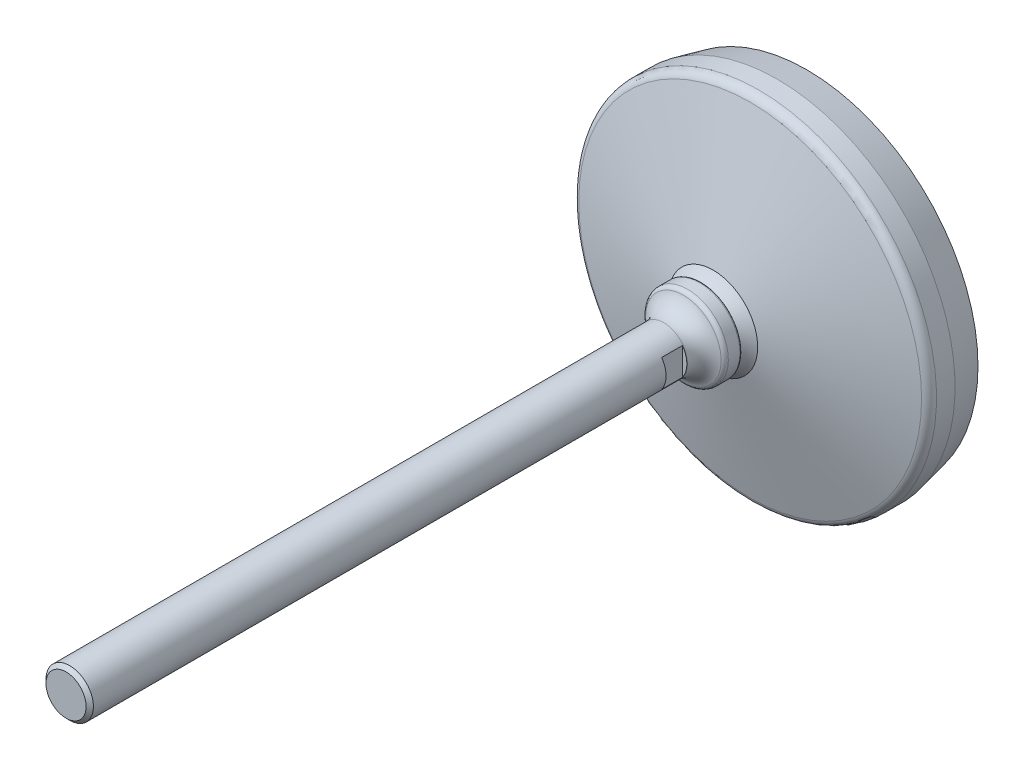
ISO-10303-21;
HEADER;
FILE_DESCRIPTION(('STEP AP214'),'2;1');
FILE_NAME('part.step','',(''),(''),'','','');
FILE_SCHEMA(('AUTOMOTIVE_DESIGN { 1 0 10303 214 1 1 1 1 }'));
ENDSEC;
DATA;
#1=APPLICATION_CONTEXT('core data for automotive mechanical design processes');
#2=APPLICATION_PROTOCOL_DEFINITION('international standard','automotive_design',2000,#1);
#3=PRODUCT_CONTEXT('',#1,'mechanical');
#4=PRODUCT('Part','Part','',(#3));
#5=PRODUCT_RELATED_PRODUCT_CATEGORY('part','',(#4));
#6=PRODUCT_DEFINITION_FORMATION('','',#4);
#7=PRODUCT_DEFINITION_CONTEXT('part definition',#1,'design');
#8=PRODUCT_DEFINITION('design','',#6,#7);
#9=PRODUCT_DEFINITION_SHAPE('','',#8);
#10=(LENGTH_UNIT() NAMED_UNIT(*) SI_UNIT(.MILLI.,.METRE.));
#11=(NAMED_UNIT(*) PLANE_ANGLE_UNIT() SI_UNIT($,.RADIAN.));
#12=(NAMED_UNIT(*) SI_UNIT($,.STERADIAN.) SOLID_ANGLE_UNIT());
#13=UNCERTAINTY_MEASURE_WITH_UNIT(LENGTH_MEASURE(1.E-05),#10,'distance_accuracy_value','');
#14=(GEOMETRIC_REPRESENTATION_CONTEXT(3) GLOBAL_UNCERTAINTY_ASSIGNED_CONTEXT((#13)) GLOBAL_UNIT_ASSIGNED_CONTEXT((#10,
#11,#12)) REPRESENTATION_CONTEXT('',''));
#15=CARTESIAN_POINT('',(0.,0.,0.));
#16=DIRECTION('',(0.,0.,1.));
#17=DIRECTION('',(1.,0.,0.));
#18=AXIS2_PLACEMENT_3D('',#15,#16,#17);
#19=CARTESIAN_POINT('',(0.,0.,40.9905717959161));
#20=DIRECTION('',(0.,0.,-1.));
#21=DIRECTION('',(0.,1.,0.));
#22=AXIS2_PLACEMENT_3D('',#19,#20,#21);
#23=TOROIDAL_SURFACE('',#22,22.4710883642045,12.0000000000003);
#24=CARTESIAN_POINT('',(0.,0.,31.6));
#25=DIRECTION('',(0.,0.,-1.));
#26=DIRECTION('',(0.,1.,0.));
#27=AXIS2_PLACEMENT_3D('',#24,#25,#26);
#28=CIRCLE('',#27,15.);
#29=CARTESIAN_POINT('',(0.,15.,31.6));
#30=VERTEX_POINT('',#29);
#31=EDGE_CURVE('E86',#30,#30,#28,.T.);
#32=ORIENTED_EDGE('',*,*,#31,.F.);
#33=EDGE_LOOP('',(#32));
#34=FACE_BOUND('',#33,.T.);
#35=CARTESIAN_POINT('',(0.,0.,35.6));
#36=DIRECTION('',(0.,0.,-1.));
#37=DIRECTION('',(0.,1.,0.));
#38=AXIS2_PLACEMENT_3D('',#35,#36,#37);
#39=CIRCLE('',#38,11.75);
#40=CARTESIAN_POINT('',(0.,11.75,35.6));
#41=VERTEX_POINT('',#40);
#42=EDGE_CURVE('E61',#41,#41,#39,.T.);
#43=ORIENTED_EDGE('',*,*,#42,.T.);
#44=EDGE_LOOP('',(#43));
#45=FACE_BOUND('',#44,.T.);
#46=ADVANCED_FACE('F14',(#34,#45),#23,.F.);
#47=CARTESIAN_POINT('',(0.,0.,31.6));
#48=DIRECTION('',(0.,0.,-1.));
#49=DIRECTION('',(0.,1.,0.));
#50=AXIS2_PLACEMENT_3D('',#47,#48,#49);
#51=CONICAL_SURFACE('',#50,15.,1.2875142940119);
#52=CARTESIAN_POINT('',(0.,0.,19.1292293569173));
#53=DIRECTION('',(0.,0.,-1.));
#54=DIRECTION('',(0.,1.,0.));
#55=AXIS2_PLACEMENT_3D('',#52,#53,#54);
#56=CIRCLE('',#55,57.8385251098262);
#57=CARTESIAN_POINT('',(0.,57.8385251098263,19.1292293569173));
#58=VERTEX_POINT('',#57);
#59=EDGE_CURVE('E89',#58,#58,#56,.T.);
#60=CARTESIAN_POINT('',(0.,57.8385251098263,19.1292293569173));
#61=CARTESIAN_POINT('',(0.,57.3922904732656,19.2591332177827));
#62=CARTESIAN_POINT('',(0.,56.9460558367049,19.3890370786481));
#63=CARTESIAN_POINT('',(0.,56.0535865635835,19.648844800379));
#64=CARTESIAN_POINT('',(0.,55.6073519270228,19.7787486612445));
#65=CARTESIAN_POINT('',(0.,54.7148826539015,20.0385563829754));
#66=CARTESIAN_POINT('',(0.,54.2686480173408,20.1684602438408));
#67=CARTESIAN_POINT('',(0.,53.3761787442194,20.4282679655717));
#68=CARTESIAN_POINT('',(0.,52.9299441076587,20.5581718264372));
#69=CARTESIAN_POINT('',(0.,52.0374748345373,20.817979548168));
#70=CARTESIAN_POINT('',(0.,51.5912401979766,20.9478834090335));
#71=CARTESIAN_POINT('',(0.,50.6987709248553,21.2076911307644));
#72=CARTESIAN_POINT('',(0.,50.2525362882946,21.3375949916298));
#73=CARTESIAN_POINT('',(0.,49.3600670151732,21.5974027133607));
#74=CARTESIAN_POINT('',(0.,48.9138323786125,21.7273065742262));
#75=CARTESIAN_POINT('',(0.,48.0213631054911,21.9871142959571));
#76=CARTESIAN_POINT('',(0.,47.5751284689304,22.1170181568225));
#77=CARTESIAN_POINT('',(0.,46.682659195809,22.3768258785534));
#78=CARTESIAN_POINT('',(0.,46.2364245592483,22.5067297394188));
#79=CARTESIAN_POINT('',(0.,45.343955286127,22.7665374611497));
#80=CARTESIAN_POINT('',(0.,44.8977206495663,22.8964413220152));
#81=CARTESIAN_POINT('',(0.,44.0052513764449,23.1562490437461));
#82=CARTESIAN_POINT('',(0.,43.5590167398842,23.2861529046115));
#83=CARTESIAN_POINT('',(0.,42.6665474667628,23.5459606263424));
#84=CARTESIAN_POINT('',(0.,42.2203128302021,23.6758644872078));
#85=CARTESIAN_POINT('',(0.,41.3278435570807,23.9356722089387));
#86=CARTESIAN_POINT('',(0.,40.8816089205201,24.0655760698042));
#87=CARTESIAN_POINT('',(0.,39.9891396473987,24.3253837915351));
#88=CARTESIAN_POINT('',(0.,39.542905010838,24.4552876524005));
#89=CARTESIAN_POINT('',(0.,38.6504357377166,24.7150953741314));
#90=CARTESIAN_POINT('',(0.,38.2042011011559,24.8449992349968));
#91=CARTESIAN_POINT('',(0.,37.3117318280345,25.1048069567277));
#92=CARTESIAN_POINT('',(0.,36.8654971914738,25.2347108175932));
#93=CARTESIAN_POINT('',(0.,35.9730279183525,25.4945185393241));
#94=CARTESIAN_POINT('',(0.,35.5267932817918,25.6244224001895));
#95=CARTESIAN_POINT('',(0.,34.6343240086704,25.8842301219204));
#96=CARTESIAN_POINT('',(0.,34.1880893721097,26.0141339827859));
#97=CARTESIAN_POINT('',(0.,33.2956200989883,26.2739417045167));
#98=CARTESIAN_POINT('',(0.,32.8493854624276,26.4038455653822));
#99=CARTESIAN_POINT('',(0.,31.9569161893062,26.6636532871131));
#100=CARTESIAN_POINT('',(0.,31.5106815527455,26.7935571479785));
#101=CARTESIAN_POINT('',(0.,30.6182122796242,27.0533648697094));
#102=CARTESIAN_POINT('',(0.,30.1719776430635,27.1832687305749));
#103=CARTESIAN_POINT('',(0.,29.2795083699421,27.4430764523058));
#104=CARTESIAN_POINT('',(0.,28.8332737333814,27.5729803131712));
#105=CARTESIAN_POINT('',(0.,27.94080446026,27.8327880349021));
#106=CARTESIAN_POINT('',(0.,27.4945698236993,27.9626918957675));
#107=CARTESIAN_POINT('',(0.,26.602100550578,28.2224996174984));
#108=CARTESIAN_POINT('',(0.,26.1558659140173,28.3524034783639));
#109=CARTESIAN_POINT('',(0.,25.2633966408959,28.6122112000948));
#110=CARTESIAN_POINT('',(0.,24.8171620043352,28.7421150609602));
#111=CARTESIAN_POINT('',(0.,23.9246927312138,29.0019227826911));
#112=CARTESIAN_POINT('',(0.,23.4784580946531,29.1318266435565));
#113=CARTESIAN_POINT('',(0.,22.5859888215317,29.3916343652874));
#114=CARTESIAN_POINT('',(0.,22.139754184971,29.5215382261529));
#115=CARTESIAN_POINT('',(0.,21.2472849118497,29.7813459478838));
#116=CARTESIAN_POINT('',(0.,20.801050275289,29.9112498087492));
#117=CARTESIAN_POINT('',(0.,19.9085810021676,30.1710575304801));
#118=CARTESIAN_POINT('',(0.,19.4623463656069,30.3009613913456));
#119=CARTESIAN_POINT('',(0.,18.5698770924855,30.5607691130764));
#120=CARTESIAN_POINT('',(0.,18.1236424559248,30.6906729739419));
#121=CARTESIAN_POINT('',(0.,17.2311731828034,30.9504806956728));
#122=CARTESIAN_POINT('',(0.,16.7849385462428,31.0803845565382));
#123=CARTESIAN_POINT('',(0.,15.8924692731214,31.3401922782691));
#124=CARTESIAN_POINT('',(0.,15.4462346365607,31.4700961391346));
#125=CARTESIAN_POINT('',(0.,15.,31.6));
#126=B_SPLINE_CURVE_WITH_KNOTS('',3,(#60,#61,#62,#63,#64,#65,#66,#67,#68,#69,#70,#71,#72,#73,
#74,#75,#76,#77,#78,#79,#80,#81,#82,#83,#84,#85,#86,#87,#88,#89,#90,#91,#92,#93,#94,#95,#96,#97,
#98,#99,#100,#101,#102,#103,#104,#105,#106,#107,#108,#109,#110,#111,#112,#113,#114,#115,#116,
#117,#118,#119,#120,#121,#122,#123,#124,#125),.UNSPECIFIED.,.F.,.F.,(4,2,2,2,2,2,2,2,2,2,2,2,2,
2,2,2,2,2,2,2,2,2,2,2,2,2,2,2,2,2,2,2,4),(0.,1.39427517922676,2.78855035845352,4.18282553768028,
5.57710071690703,6.97137589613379,8.36565107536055,9.75992625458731,11.1542014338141,
12.5484766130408,13.9427517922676,15.3370269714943,16.7313021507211,18.1255773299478,
19.5198525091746,20.9141276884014,22.3084028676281,23.7026780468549,25.0969532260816,
26.4912284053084,27.8855035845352,29.2797787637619,30.6740539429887,32.0683291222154,
33.4626043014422,34.856879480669,36.2511546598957,37.6454298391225,39.0397050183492,
40.433980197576,41.8282553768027,43.2225305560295,44.6168057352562),.UNSPECIFIED.);
#127=EDGE_CURVE('BSEAM147',#58,#30,#126,.T.);
#128=ORIENTED_EDGE('',*,*,#59,.F.);
#129=ORIENTED_EDGE('',*,*,#31,.T.);
#130=ORIENTED_EDGE('',*,*,#127,.T.);
#131=ORIENTED_EDGE('',*,*,#127,.F.);
#132=EDGE_LOOP('',(#128,#130,#129,#131));
#133=FACE_BOUND('',#132,.T.);
#134=ADVANCED_FACE('F147',(#133),#51,.T.);
#135=CARTESIAN_POINT('',(0.,0.,16.2487995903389));
#136=DIRECTION('',(0.,0.,-1.));
#137=DIRECTION('',(0.,1.,0.));
#138=AXIS2_PLACEMENT_3D('',#135,#136,#137);
#139=TOROIDAL_SURFACE('',#138,57.,2.99999999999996);
#140=ORIENTED_EDGE('',*,*,#59,.T.);
#141=EDGE_LOOP('',(#140));
#142=FACE_BOUND('',#141,.T.);
#143=CARTESIAN_POINT('',(0.,0.,16.2487995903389));
#144=DIRECTION('',(0.,0.,-1.));
#145=DIRECTION('',(0.,1.,0.));
#146=AXIS2_PLACEMENT_3D('',#143,#144,#145);
#147=CIRCLE('',#146,60.);
#148=CARTESIAN_POINT('',(0.,60.,16.2487995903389));
#149=VERTEX_POINT('',#148);
#150=EDGE_CURVE('E92',#149,#149,#147,.T.);
#151=ORIENTED_EDGE('',*,*,#150,.F.);
#152=EDGE_LOOP('',(#151));
#153=FACE_BOUND('',#152,.T.);
#154=ADVANCED_FACE('F153',(#142,#153),#139,.T.);
#155=CARTESIAN_POINT('',(0.,0.,0.));
#156=DIRECTION('',(0.,0.,-1.));
#157=DIRECTION('',(0.,1.,0.));
#158=AXIS2_PLACEMENT_3D('',#155,#156,#157);
#159=CYLINDRICAL_SURFACE('',#158,60.);
#160=CARTESIAN_POINT('',(0.,0.,10.));
#161=DIRECTION('',(0.,0.,-1.));
#162=DIRECTION('',(0.,1.,0.));
#163=AXIS2_PLACEMENT_3D('',#160,#161,#162);
#164=CIRCLE('',#163,60.);
#165=CARTESIAN_POINT('',(0.,60.,10.));
#166=VERTEX_POINT('',#165);
#167=EDGE_CURVE('E95',#166,#166,#164,.T.);
#168=ORIENTED_EDGE('',*,*,#167,.F.);
#169=EDGE_LOOP('',(#168));
#170=FACE_BOUND('',#169,.T.);
#171=ORIENTED_EDGE('',*,*,#150,.T.);
#172=EDGE_LOOP('',(#171));
#173=FACE_BOUND('',#172,.T.);
#174=ADVANCED_FACE('F198',(#170,#173),#159,.T.);
#175=CARTESIAN_POINT('',(0.,0.,10.));
#176=DIRECTION('',(0.,0.,1.));
#177=DIRECTION('',(0.,-1.,0.));
#178=AXIS2_PLACEMENT_3D('',#175,#176,#177);
#179=CONICAL_SURFACE('',#178,60.,0.221314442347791);
#180=CARTESIAN_POINT('',(0.,0.,0.));
#181=DIRECTION('',(0.,0.,-1.));
#182=DIRECTION('',(0.,1.,0.));
#183=AXIS2_PLACEMENT_3D('',#180,#181,#182);
#184=CIRCLE('',#183,57.75);
#185=CARTESIAN_POINT('',(0.,57.75,0.));
#186=VERTEX_POINT('',#185);
#187=EDGE_CURVE('E98',#186,#186,#184,.T.);
#188=ORIENTED_EDGE('',*,*,#187,.F.);
#189=EDGE_LOOP('',(#188));
#190=FACE_BOUND('',#189,.T.);
#191=ORIENTED_EDGE('',*,*,#167,.T.);
#192=EDGE_LOOP('',(#191));
#193=FACE_BOUND('',#192,.T.);
#194=ADVANCED_FACE('F194',(#190,#193),#179,.T.);
#195=CARTESIAN_POINT('',(57.75,0.,0.));
#196=DIRECTION('',(0.,0.,1.));
#197=DIRECTION('',(0.,-1.,0.));
#198=AXIS2_PLACEMENT_3D('',#195,#196,#197);
#199=PLANE('',#198);
#200=ORIENTED_EDGE('',*,*,#187,.T.);
#201=EDGE_LOOP('',(#200));
#202=FACE_BOUND('',#201,.T.);
#203=ADVANCED_FACE('F187',(#202),#199,.F.);
#204=CARTESIAN_POINT('',(0.,0.,16.));
#205=DIRECTION('',(0.,0.,-1.));
#206=DIRECTION('',(0.,1.,0.));
#207=AXIS2_PLACEMENT_3D('',#204,#205,#206);
#208=CYLINDRICAL_SURFACE('',#207,8.);
#209=CARTESIAN_POINT('',(0.,0.,48.3));
#210=DIRECTION('',(0.,0.,-1.));
#211=DIRECTION('',(0.,1.,0.));
#212=AXIS2_PLACEMENT_3D('',#209,#210,#211);
#213=CIRCLE('',#212,8.);
#214=CARTESIAN_POINT('',(0.,8.,48.3));
#215=VERTEX_POINT('',#214);
#216=EDGE_CURVE('E107',#215,#215,#213,.T.);
#217=ORIENTED_EDGE('',*,*,#216,.F.);
#218=EDGE_LOOP('',(#217));
#219=FACE_BOUND('',#218,.T.);
#220=DIRECTION('',(0.,0.,-1.));
#221=VECTOR('',#220,1.);
#222=CARTESIAN_POINT('',(6.5,-4.66368952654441,16.));
#223=LINE('',#222,#221);
#224=CARTESIAN_POINT('',(6.5,-4.66368952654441,48.5));
#225=VERTEX_POINT('',#224);
#226=CARTESIAN_POINT('',(6.5,-4.66368952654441,55.5));
#227=VERTEX_POINT('',#226);
#228=EDGE_CURVE('E77',#225,#227,#223,.F.);
#229=ORIENTED_EDGE('',*,*,#228,.T.);
#230=CARTESIAN_POINT('',(0.,0.,55.5));
#231=DIRECTION('',(0.,0.,1.));
#232=DIRECTION('',(0.,-1.,0.));
#233=AXIS2_PLACEMENT_3D('',#230,#231,#232);
#234=CIRCLE('',#233,8.);
#235=CARTESIAN_POINT('',(6.5,4.66368952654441,55.5));
#236=VERTEX_POINT('',#235);
#237=EDGE_CURVE('E9',#227,#236,#234,.T.);
#238=ORIENTED_EDGE('',*,*,#237,.T.);
#239=DIRECTION('',(0.,0.,-1.));
#240=VECTOR('',#239,1.);
#241=CARTESIAN_POINT('',(6.5,4.66368952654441,16.));
#242=LINE('',#241,#240);
#243=CARTESIAN_POINT('',(6.5,4.66368952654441,48.5));
#244=VERTEX_POINT('',#243);
#245=EDGE_CURVE('E17',#236,#244,#242,.T.);
#246=ORIENTED_EDGE('',*,*,#245,.T.);
#247=CARTESIAN_POINT('',(0.,0.,48.5));
#248=DIRECTION('',(0.,0.,1.));
#249=DIRECTION('',(0.,-1.,0.));
#250=AXIS2_PLACEMENT_3D('',#247,#248,#249);
#251=CIRCLE('',#250,8.);
#252=EDGE_CURVE('E63',#225,#244,#251,.T.);
#253=ORIENTED_EDGE('',*,*,#252,.F.);
#254=EDGE_LOOP('',(#229,#238,#246,#253));
#255=FACE_BOUND('',#254,.T.);
#256=DIRECTION('',(0.,0.,-1.));
#257=VECTOR('',#256,1.);
#258=CARTESIAN_POINT('',(-6.5,4.66368952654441,16.));
#259=LINE('',#258,#257);
#260=CARTESIAN_POINT('',(-6.5,4.66368952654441,48.5));
#261=VERTEX_POINT('',#260);
#262=CARTESIAN_POINT('',(-6.5,4.66368952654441,55.5));
#263=VERTEX_POINT('',#262);
#264=EDGE_CURVE('E60',#261,#263,#259,.F.);
#265=ORIENTED_EDGE('',*,*,#264,.T.);
#266=CARTESIAN_POINT('',(-6.5,-4.66368952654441,55.5));
#267=VERTEX_POINT('',#266);
#268=EDGE_CURVE('E23',#263,#267,#234,.T.);
#269=ORIENTED_EDGE('',*,*,#268,.T.);
#270=DIRECTION('',(0.,0.,-1.));
#271=VECTOR('',#270,1.);
#272=CARTESIAN_POINT('',(-6.5,-4.66368952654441,16.));
#273=LINE('',#272,#271);
#274=CARTESIAN_POINT('',(-6.5,-4.66368952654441,48.5));
#275=VERTEX_POINT('',#274);
#276=EDGE_CURVE('E67',#267,#275,#273,.T.);
#277=ORIENTED_EDGE('',*,*,#276,.T.);
#278=EDGE_CURVE('E55',#261,#275,#251,.T.);
#279=ORIENTED_EDGE('',*,*,#278,.F.);
#280=EDGE_LOOP('',(#265,#269,#277,#279));
#281=FACE_BOUND('',#280,.T.);
#282=CARTESIAN_POINT('',(0.,0.,248.773));
#283=DIRECTION('',(0.,0.,-1.));
#284=DIRECTION('',(0.,1.,0.));
#285=AXIS2_PLACEMENT_3D('',#282,#283,#284);
#286=CIRCLE('',#285,8.);
#287=CARTESIAN_POINT('',(0.,8.,248.773));
#288=VERTEX_POINT('',#287);
#289=EDGE_CURVE('E104',#288,#288,#286,.T.);
#290=ORIENTED_EDGE('',*,*,#289,.T.);
#291=EDGE_LOOP('',(#290));
#292=FACE_BOUND('',#291,.T.);
#293=ADVANCED_FACE('F73',(#219,#255,#281,#292),#208,.T.);
#294=CARTESIAN_POINT('',(0.,0.,48.3));
#295=DIRECTION('',(0.,0.,-1.));
#296=DIRECTION('',(0.,1.,0.));
#297=AXIS2_PLACEMENT_3D('',#294,#295,#296);
#298=TOROIDAL_SURFACE('',#297,15.,7.);
#299=CARTESIAN_POINT('',(0.,0.,41.6764732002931));
#300=DIRECTION('',(0.,0.,-1.));
#301=DIRECTION('',(0.,1.,0.));
#302=AXIS2_PLACEMENT_3D('',#299,#300,#301);
#303=CIRCLE('',#302,12.7352941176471);
#304=CARTESIAN_POINT('',(0.,12.7352941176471,41.6764732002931));
#305=VERTEX_POINT('',#304);
#306=EDGE_CURVE('E110',#305,#305,#303,.T.);
#307=ORIENTED_EDGE('',*,*,#306,.F.);
#308=EDGE_LOOP('',(#307));
#309=FACE_BOUND('',#308,.T.);
#310=ORIENTED_EDGE('',*,*,#216,.T.);
#311=EDGE_LOOP('',(#310));
#312=FACE_BOUND('',#311,.T.);
#313=ADVANCED_FACE('F180',(#309,#312),#298,.F.);
#314=CARTESIAN_POINT('',(0.,0.,40.2571460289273));
#315=DIRECTION('',(0.,0.,-1.));
#316=DIRECTION('',(0.,1.,0.));
#317=AXIS2_PLACEMENT_3D('',#314,#315,#316);
#318=TOROIDAL_SURFACE('',#317,12.25,1.49999999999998);
#319=ORIENTED_EDGE('',*,*,#306,.T.);
#320=EDGE_LOOP('',(#319));
#321=FACE_BOUND('',#320,.T.);
#322=CARTESIAN_POINT('',(0.,0.,40.2571460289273));
#323=DIRECTION('',(0.,0.,-1.));
#324=DIRECTION('',(0.,1.,0.));
#325=AXIS2_PLACEMENT_3D('',#322,#323,#324);
#326=CIRCLE('',#325,13.75);
#327=CARTESIAN_POINT('',(0.,13.75,40.2571460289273));
#328=VERTEX_POINT('',#327);
#329=EDGE_CURVE('E113',#328,#328,#326,.T.);
#330=ORIENTED_EDGE('',*,*,#329,.F.);
#331=EDGE_LOOP('',(#330));
#332=FACE_BOUND('',#331,.T.);
#333=ADVANCED_FACE('F173',(#321,#332),#318,.T.);
#334=CARTESIAN_POINT('',(0.,0.,16.));
#335=DIRECTION('',(0.,0.,-1.));
#336=DIRECTION('',(0.,1.,0.));
#337=AXIS2_PLACEMENT_3D('',#334,#335,#336);
#338=CYLINDRICAL_SURFACE('',#337,13.75);
#339=CARTESIAN_POINT('',(0.,0.,36.35));
#340=DIRECTION('',(0.,0.,-1.));
#341=DIRECTION('',(0.,1.,0.));
#342=AXIS2_PLACEMENT_3D('',#339,#340,#341);
#343=CIRCLE('',#342,13.75);
#344=CARTESIAN_POINT('',(0.,13.75,36.35));
#345=VERTEX_POINT('',#344);
#346=EDGE_CURVE('E116',#345,#345,#343,.T.);
#347=ORIENTED_EDGE('',*,*,#346,.F.);
#348=EDGE_LOOP('',(#347));
#349=FACE_BOUND('',#348,.T.);
#350=ORIENTED_EDGE('',*,*,#329,.T.);
#351=EDGE_LOOP('',(#350));
#352=FACE_BOUND('',#351,.T.);
#353=ADVANCED_FACE('F166',(#349,#352),#338,.T.);
#354=CARTESIAN_POINT('',(0.,0.,36.35));
#355=DIRECTION('',(0.,0.,-1.));
#356=DIRECTION('',(0.,1.,0.));
#357=AXIS2_PLACEMENT_3D('',#354,#355,#356);
#358=TOROIDAL_SURFACE('',#357,13.,0.75);
#359=ORIENTED_EDGE('',*,*,#346,.T.);
#360=EDGE_LOOP('',(#359));
#361=FACE_BOUND('',#360,.T.);
#362=CARTESIAN_POINT('',(0.,0.,35.6));
#363=DIRECTION('',(0.,0.,-1.));
#364=DIRECTION('',(0.,1.,0.));
#365=AXIS2_PLACEMENT_3D('',#362,#363,#364);
#366=CIRCLE('',#365,13.);
#367=CARTESIAN_POINT('',(0.,13.,35.6));
#368=VERTEX_POINT('',#367);
#369=EDGE_CURVE('E119',#368,#368,#366,.T.);
#370=ORIENTED_EDGE('',*,*,#369,.F.);
#371=EDGE_LOOP('',(#370));
#372=FACE_BOUND('',#371,.T.);
#373=ADVANCED_FACE('F161',(#361,#372),#358,.T.);
#374=CARTESIAN_POINT('',(13.,0.,35.6));
#375=DIRECTION('',(0.,0.,1.));
#376=DIRECTION('',(0.,-1.,0.));
#377=AXIS2_PLACEMENT_3D('',#374,#375,#376);
#378=PLANE('',#377);
#379=ORIENTED_EDGE('',*,*,#42,.F.);
#380=EDGE_LOOP('',(#379));
#381=FACE_BOUND('',#380,.T.);
#382=ORIENTED_EDGE('',*,*,#369,.T.);
#383=EDGE_LOOP('',(#382));
#384=FACE_BOUND('',#383,.T.);
#385=ADVANCED_FACE('F145',(#381,#384),#378,.F.);
#386=CARTESIAN_POINT('',(0.,0.,48.5));
#387=DIRECTION('',(0.,0.,1.));
#388=DIRECTION('',(0.,-1.,0.));
#389=AXIS2_PLACEMENT_3D('',#386,#387,#388);
#390=PLANE('',#389);
#391=ORIENTED_EDGE('',*,*,#278,.T.);
#392=DIRECTION('',(0.,-1.,0.));
#393=VECTOR('',#392,1.);
#394=CARTESIAN_POINT('',(-6.5,16.,48.5));
#395=LINE('',#394,#393);
#396=EDGE_CURVE('E29',#261,#275,#395,.T.);
#397=ORIENTED_EDGE('',*,*,#396,.F.);
#398=EDGE_LOOP('',(#391,#397));
#399=FACE_BOUND('',#398,.T.);
#400=ADVANCED_FACE('F56',(#399),#390,.T.);
#401=CARTESIAN_POINT('',(0.,0.,55.5));
#402=DIRECTION('',(0.,0.,1.));
#403=DIRECTION('',(0.,-1.,0.));
#404=AXIS2_PLACEMENT_3D('',#401,#402,#403);
#405=PLANE('',#404);
#406=DIRECTION('',(0.,-1.,0.));
#407=VECTOR('',#406,1.);
#408=CARTESIAN_POINT('',(-6.5,16.,55.5));
#409=LINE('',#408,#407);
#410=EDGE_CURVE('E121',#263,#267,#409,.T.);
#411=ORIENTED_EDGE('',*,*,#410,.T.);
#412=ORIENTED_EDGE('',*,*,#268,.F.);
#413=EDGE_LOOP('',(#411,#412));
#414=FACE_BOUND('',#413,.T.);
#415=ADVANCED_FACE('F142',(#414),#405,.F.);
#416=CARTESIAN_POINT('',(-6.5,16.,55.5));
#417=DIRECTION('',(1.,0.,0.));
#418=DIRECTION('',(0.,1.,0.));
#419=AXIS2_PLACEMENT_3D('',#416,#417,#418);
#420=PLANE('',#419);
#421=ORIENTED_EDGE('',*,*,#410,.F.);
#422=ORIENTED_EDGE('',*,*,#264,.F.);
#423=ORIENTED_EDGE('',*,*,#396,.T.);
#424=ORIENTED_EDGE('',*,*,#276,.F.);
#425=EDGE_LOOP('',(#421,#422,#423,#424));
#426=FACE_BOUND('',#425,.T.);
#427=ADVANCED_FACE('F66',(#426),#420,.F.);
#428=CARTESIAN_POINT('',(6.5,-16.,55.5));
#429=DIRECTION('',(-1.,0.,0.));
#430=DIRECTION('',(0.,-1.,0.));
#431=AXIS2_PLACEMENT_3D('',#428,#429,#430);
#432=PLANE('',#431);
#433=DIRECTION('',(0.,1.,0.));
#434=VECTOR('',#433,1.);
#435=CARTESIAN_POINT('',(6.5,-16.,55.5));
#436=LINE('',#435,#434);
#437=EDGE_CURVE('E69',#227,#236,#436,.T.);
#438=ORIENTED_EDGE('',*,*,#437,.F.);
#439=ORIENTED_EDGE('',*,*,#228,.F.);
#440=DIRECTION('',(0.,1.,0.));
#441=VECTOR('',#440,1.);
#442=CARTESIAN_POINT('',(6.5,-16.,48.5));
#443=LINE('',#442,#441);
#444=EDGE_CURVE('E70',#225,#244,#443,.T.);
#445=ORIENTED_EDGE('',*,*,#444,.T.);
#446=ORIENTED_EDGE('',*,*,#245,.F.);
#447=EDGE_LOOP('',(#438,#439,#445,#446));
#448=FACE_BOUND('',#447,.T.);
#449=ADVANCED_FACE('F127',(#448),#432,.F.);
#450=ORIENTED_EDGE('',*,*,#437,.T.);
#451=ORIENTED_EDGE('',*,*,#237,.F.);
#452=EDGE_LOOP('',(#450,#451));
#453=FACE_BOUND('',#452,.T.);
#454=ADVANCED_FACE('F126',(#453),#405,.F.);
#455=ORIENTED_EDGE('',*,*,#444,.F.);
#456=ORIENTED_EDGE('',*,*,#252,.T.);
#457=EDGE_LOOP('',(#455,#456));
#458=FACE_BOUND('',#457,.T.);
#459=ADVANCED_FACE('F128',(#458),#390,.T.);
#460=CARTESIAN_POINT('',(0.,0.,250.));
#461=DIRECTION('',(0.,0.,-1.));
#462=DIRECTION('',(0.,1.,0.));
#463=AXIS2_PLACEMENT_3D('',#460,#461,#462);
#464=PLANE('',#463);
#465=CARTESIAN_POINT('',(0.,0.,250.));
#466=DIRECTION('',(0.,0.,-1.));
#467=DIRECTION('',(0.,1.,0.));
#468=AXIS2_PLACEMENT_3D('',#465,#466,#467);
#469=CIRCLE('',#468,6.773);
#470=CARTESIAN_POINT('',(0.,6.773,250.));
#471=VERTEX_POINT('',#470);
#472=EDGE_CURVE('E101',#471,#471,#469,.T.);
#473=ORIENTED_EDGE('',*,*,#472,.F.);
#474=EDGE_LOOP('',(#473));
#475=FACE_BOUND('',#474,.T.);
#476=ADVANCED_FACE('F130',(#475),#464,.F.);
#477=CARTESIAN_POINT('',(0.,0.,250.));
#478=DIRECTION('',(0.,0.,-1.));
#479=DIRECTION('',(0.,1.,0.));
#480=AXIS2_PLACEMENT_3D('',#477,#478,#479);
#481=CONICAL_SURFACE('',#480,6.773,0.785398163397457);
#482=ORIENTED_EDGE('',*,*,#289,.F.);
#483=EDGE_LOOP('',(#482));
#484=FACE_BOUND('',#483,.T.);
#485=ORIENTED_EDGE('',*,*,#472,.T.);
#486=EDGE_LOOP('',(#485));
#487=FACE_BOUND('',#486,.T.);
#488=ADVANCED_FACE('F138',(#484,#487),#481,.T.);
#489=CLOSED_SHELL('',(#46,#134,#154,#174,#194,#203,#293,#313,#333,#353,#373,#385,#400,#415,#427,
#449,#454,#459,#476,#488));
#490=MANIFOLD_SOLID_BREP('B1',#489);
#491=ADVANCED_BREP_SHAPE_REPRESENTATION('',(#18,#490),#14);
#492=SHAPE_DEFINITION_REPRESENTATION(#9,#491);
ENDSEC;
END-ISO-10303-21;
